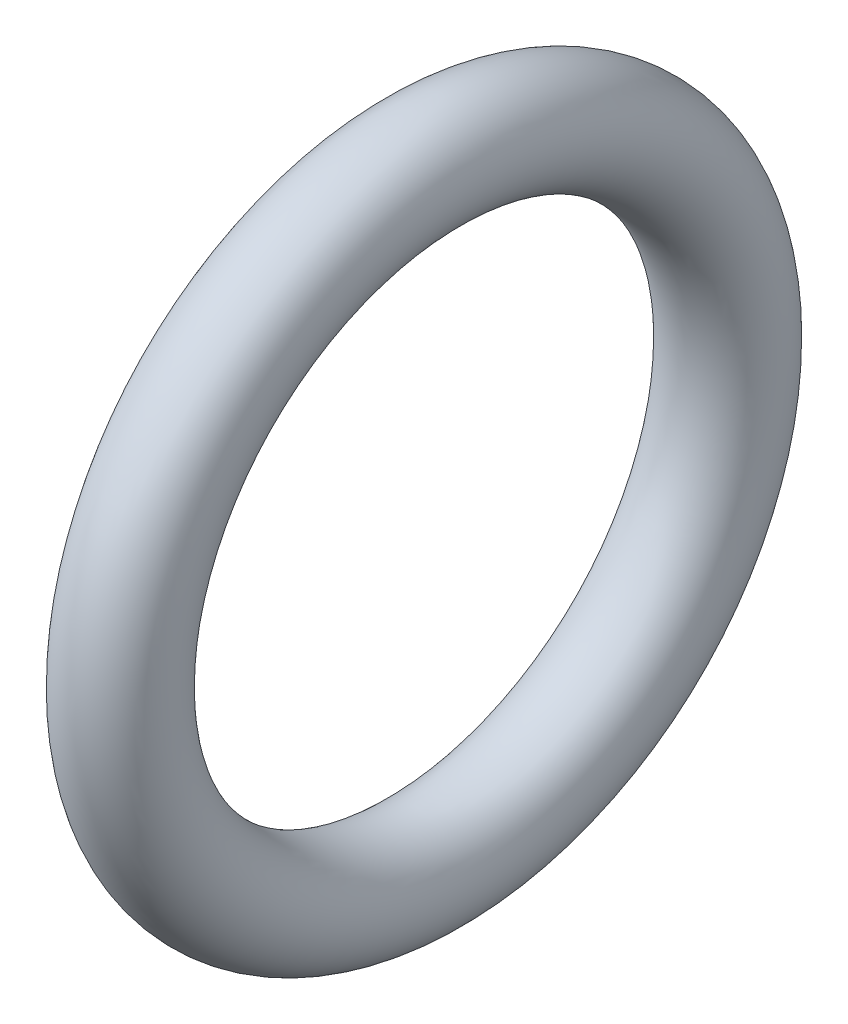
from build123d import *

# Parameters (mm, degrees)
SKETCH_1_R = 1.25


with BuildPart() as part:
    # Sketch 1 → Revolve 1 (revolve)
    with BuildSketch(Plane.XY, mode=Mode.PRIVATE) as revolve_1_sk:
        with Locations((0, 7.25)):
            Circle(SKETCH_1_R)
    revolve(revolve_1_sk.sketch.rotate(Axis((0, 0, 0), (1, 0, 0)), 90), axis=Axis((0, 0, 0), (1, 0, 0)))


solid = part.part
